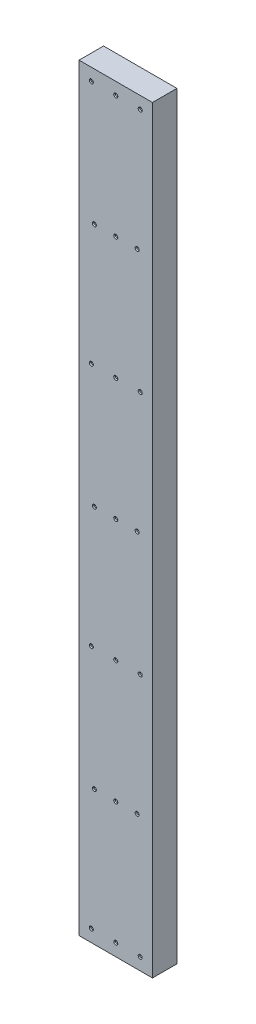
from build123d import *

# Parameters (mm, degrees)
SKETCH1_W                                         = 152.4
SKETCH1_H                                         = 50.8
BOSS_EXTRUDE1_DEPTH                               = 1574.8
CSK_FOR_8_FLAT_HEAD_MACHINE_SCREW_100_D           = 4.4958
CSK_FOR_8_FLAT_HEAD_MACHINE_SCREW_100_CSINK_D     = 8.4328
CSK_FOR_8_FLAT_HEAD_MACHINE_SCREW_100_CSINK_ANGLE = 100
CSK_FOR_8_FLAT_HEAD_MACHINE_SCREW_2_D             = 4.4958
CSK_FOR_8_FLAT_HEAD_MACHINE_SCREW_2_CSINK_D       = 8.4328
CSK_FOR_8_FLAT_HEAD_MACHINE_SCREW_2_CSINK_ANGLE   = 100


with BuildPart() as part:
    # Sketch1 → Boss-Extrude1 (new body)
    with BuildSketch(Plane(origin=(0, 0, 0), x_dir=(1, 0, 0), z_dir=(0, 1, 0))):
        Rectangle(SKETCH1_W, SKETCH1_H)
    extrude(amount=BOSS_EXTRUDE1_DEPTH)

    # CSK for _8 Flat Head Machine Screw _100 (through all)
    with Locations(Plane.XY.offset(25.4)):
        with Locations((-50.8, 25.4), (0, 25.4), (50.8, 25.4), (-50.8, 1549.4), (0, 1549.4), (50.8, 1549.4), (-50.8, 1041.4), (0, 1041.4), (50.8, 1041.4), (-50.8, 533.4), (0, 533.4), (50.8, 533.4)):
            CounterSinkHole(CSK_FOR_8_FLAT_HEAD_MACHINE_SCREW_100_D / 2, CSK_FOR_8_FLAT_HEAD_MACHINE_SCREW_100_CSINK_D / 2, counter_sink_angle=CSK_FOR_8_FLAT_HEAD_MACHINE_SCREW_100_CSINK_ANGLE)

    # CSK for _8 Flat Head Machine Screw _ 2 (through all)
    with Locations(Plane.XY.offset(25.4)):
        with Locations((-44.45, 279.4), (0, 279.4), (44.45, 279.4), (-44.45, 787.4), (0, 787.4), (44.45, 787.4), (-44.45, 1295.4), (0, 1295.4), (44.45, 1295.4)):
            CounterSinkHole(CSK_FOR_8_FLAT_HEAD_MACHINE_SCREW_2_D / 2, CSK_FOR_8_FLAT_HEAD_MACHINE_SCREW_2_CSINK_D / 2, counter_sink_angle=CSK_FOR_8_FLAT_HEAD_MACHINE_SCREW_2_CSINK_ANGLE)


solid = part.part
